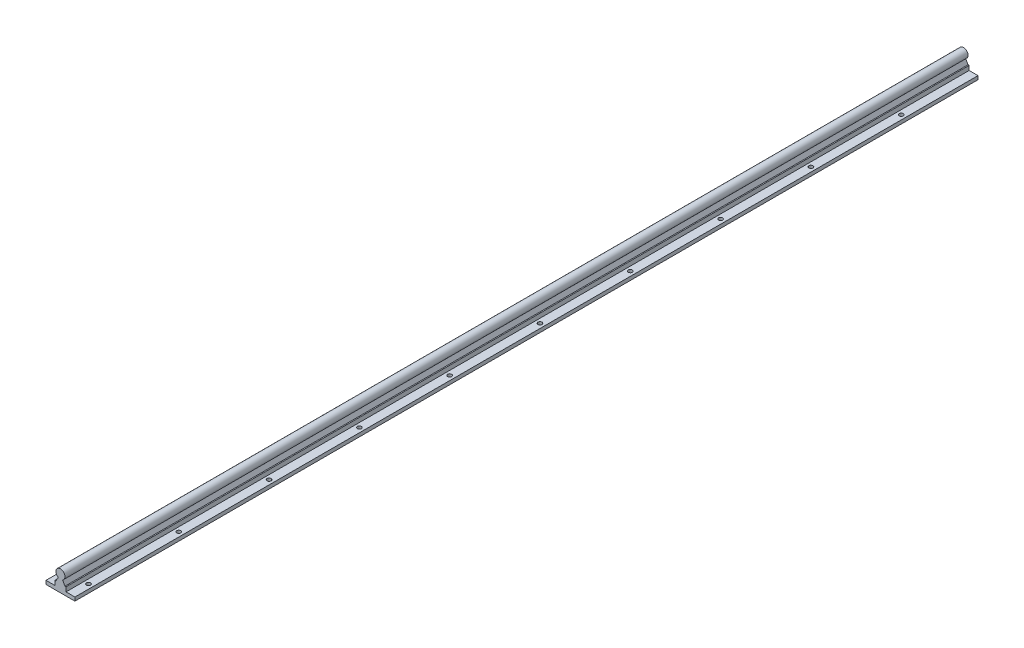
ISO-10303-21;
HEADER;
FILE_DESCRIPTION(('STEP AP214'),'2;1');
FILE_NAME('part.step','',(''),(''),'','','');
FILE_SCHEMA(('AUTOMOTIVE_DESIGN { 1 0 10303 214 1 1 1 1 }'));
ENDSEC;
DATA;
#1=APPLICATION_CONTEXT('core data for automotive mechanical design processes');
#2=APPLICATION_PROTOCOL_DEFINITION('international standard','automotive_design',2000,#1);
#3=PRODUCT_CONTEXT('',#1,'mechanical');
#4=PRODUCT('Part','Part','',(#3));
#5=PRODUCT_RELATED_PRODUCT_CATEGORY('part','',(#4));
#6=PRODUCT_DEFINITION_FORMATION('','',#4);
#7=PRODUCT_DEFINITION_CONTEXT('part definition',#1,'design');
#8=PRODUCT_DEFINITION('design','',#6,#7);
#9=PRODUCT_DEFINITION_SHAPE('','',#8);
#10=(LENGTH_UNIT() NAMED_UNIT(*) SI_UNIT(.MILLI.,.METRE.));
#11=(NAMED_UNIT(*) PLANE_ANGLE_UNIT() SI_UNIT($,.RADIAN.));
#12=(NAMED_UNIT(*) SI_UNIT($,.STERADIAN.) SOLID_ANGLE_UNIT());
#13=UNCERTAINTY_MEASURE_WITH_UNIT(LENGTH_MEASURE(1.E-05),#10,'distance_accuracy_value','');
#14=(GEOMETRIC_REPRESENTATION_CONTEXT(3) GLOBAL_UNCERTAINTY_ASSIGNED_CONTEXT((#13)) GLOBAL_UNIT_ASSIGNED_CONTEXT((#10,
#11,#12)) REPRESENTATION_CONTEXT('',''));
#15=CARTESIAN_POINT('',(0.,0.,0.));
#16=DIRECTION('',(0.,0.,1.));
#17=DIRECTION('',(1.,0.,0.));
#18=AXIS2_PLACEMENT_3D('',#15,#16,#17);
#19=CARTESIAN_POINT('',(-6.2,-7.50000000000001,1000.));
#20=DIRECTION('',(0.,-1.,0.));
#21=DIRECTION('',(0.,0.,-1.));
#22=AXIS2_PLACEMENT_3D('',#19,#20,#21);
#23=PLANE('',#22);
#24=CARTESIAN_POINT('',(-11.,-7.50000000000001,180.000000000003));
#25=DIRECTION('',(0.,1.,0.));
#26=DIRECTION('',(0.,0.,1.));
#27=AXIS2_PLACEMENT_3D('',#24,#25,#26);
#28=CIRCLE('',#27,2.25);
#29=CARTESIAN_POINT('',(-11.,-7.50000000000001,182.250000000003));
#30=VERTEX_POINT('',#29);
#31=EDGE_CURVE('E779',#30,#30,#28,.T.);
#32=ORIENTED_EDGE('',*,*,#31,.F.);
#33=EDGE_LOOP('',(#32));
#34=FACE_BOUND('',#33,.T.);
#35=CARTESIAN_POINT('',(-11.,-7.50000000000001,280.000000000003));
#36=DIRECTION('',(0.,1.,0.));
#37=DIRECTION('',(0.,0.,1.));
#38=AXIS2_PLACEMENT_3D('',#35,#36,#37);
#39=CIRCLE('',#38,2.25);
#40=CARTESIAN_POINT('',(-11.,-7.50000000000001,282.250000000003));
#41=VERTEX_POINT('',#40);
#42=EDGE_CURVE('E789',#41,#41,#39,.T.);
#43=ORIENTED_EDGE('',*,*,#42,.F.);
#44=EDGE_LOOP('',(#43));
#45=FACE_BOUND('',#44,.T.);
#46=CARTESIAN_POINT('',(-11.,-7.50000000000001,380.000000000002));
#47=DIRECTION('',(0.,1.,0.));
#48=DIRECTION('',(0.,0.,1.));
#49=AXIS2_PLACEMENT_3D('',#46,#47,#48);
#50=CIRCLE('',#49,2.25);
#51=CARTESIAN_POINT('',(-11.,-7.50000000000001,382.250000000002));
#52=VERTEX_POINT('',#51);
#53=EDGE_CURVE('E797',#52,#52,#50,.T.);
#54=ORIENTED_EDGE('',*,*,#53,.F.);
#55=EDGE_LOOP('',(#54));
#56=FACE_BOUND('',#55,.T.);
#57=CARTESIAN_POINT('',(-11.,-7.50000000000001,480.000000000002));
#58=DIRECTION('',(0.,1.,0.));
#59=DIRECTION('',(0.,0.,1.));
#60=AXIS2_PLACEMENT_3D('',#57,#58,#59);
#61=CIRCLE('',#60,2.25);
#62=CARTESIAN_POINT('',(-11.,-7.50000000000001,482.250000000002));
#63=VERTEX_POINT('',#62);
#64=EDGE_CURVE('E805',#63,#63,#61,.T.);
#65=ORIENTED_EDGE('',*,*,#64,.F.);
#66=EDGE_LOOP('',(#65));
#67=FACE_BOUND('',#66,.T.);
#68=CARTESIAN_POINT('',(-11.,-7.50000000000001,580.000000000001));
#69=DIRECTION('',(0.,1.,0.));
#70=DIRECTION('',(0.,0.,1.));
#71=AXIS2_PLACEMENT_3D('',#68,#69,#70);
#72=CIRCLE('',#71,2.25);
#73=CARTESIAN_POINT('',(-11.,-7.50000000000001,582.250000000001));
#74=VERTEX_POINT('',#73);
#75=EDGE_CURVE('E813',#74,#74,#72,.T.);
#76=ORIENTED_EDGE('',*,*,#75,.F.);
#77=EDGE_LOOP('',(#76));
#78=FACE_BOUND('',#77,.T.);
#79=CARTESIAN_POINT('',(-11.,-7.50000000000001,680.000000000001));
#80=DIRECTION('',(0.,1.,0.));
#81=DIRECTION('',(0.,0.,1.));
#82=AXIS2_PLACEMENT_3D('',#79,#80,#81);
#83=CIRCLE('',#82,2.25);
#84=CARTESIAN_POINT('',(-11.,-7.50000000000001,682.250000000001));
#85=VERTEX_POINT('',#84);
#86=EDGE_CURVE('E821',#85,#85,#83,.T.);
#87=ORIENTED_EDGE('',*,*,#86,.F.);
#88=EDGE_LOOP('',(#87));
#89=FACE_BOUND('',#88,.T.);
#90=CARTESIAN_POINT('',(-11.,-7.50000000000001,780.000000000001));
#91=DIRECTION('',(0.,1.,0.));
#92=DIRECTION('',(0.,0.,1.));
#93=AXIS2_PLACEMENT_3D('',#90,#91,#92);
#94=CIRCLE('',#93,2.25);
#95=CARTESIAN_POINT('',(-11.,-7.50000000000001,782.250000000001));
#96=VERTEX_POINT('',#95);
#97=EDGE_CURVE('E829',#96,#96,#94,.T.);
#98=ORIENTED_EDGE('',*,*,#97,.F.);
#99=EDGE_LOOP('',(#98));
#100=FACE_BOUND('',#99,.T.);
#101=CARTESIAN_POINT('',(-11.,-7.50000000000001,880.));
#102=DIRECTION('',(0.,1.,0.));
#103=DIRECTION('',(0.,0.,1.));
#104=AXIS2_PLACEMENT_3D('',#101,#102,#103);
#105=CIRCLE('',#104,2.25);
#106=CARTESIAN_POINT('',(-11.,-7.50000000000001,882.25));
#107=VERTEX_POINT('',#106);
#108=EDGE_CURVE('E837',#107,#107,#105,.T.);
#109=ORIENTED_EDGE('',*,*,#108,.F.);
#110=EDGE_LOOP('',(#109));
#111=FACE_BOUND('',#110,.T.);
#112=CARTESIAN_POINT('',(-11.,-7.50000000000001,980.));
#113=DIRECTION('',(0.,1.,0.));
#114=DIRECTION('',(0.,0.,1.));
#115=AXIS2_PLACEMENT_3D('',#112,#113,#114);
#116=CIRCLE('',#115,2.25);
#117=CARTESIAN_POINT('',(-11.,-7.50000000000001,982.25));
#118=VERTEX_POINT('',#117);
#119=EDGE_CURVE('E917',#118,#118,#116,.T.);
#120=ORIENTED_EDGE('',*,*,#119,.F.);
#121=EDGE_LOOP('',(#120));
#122=FACE_BOUND('',#121,.T.);
#123=DIRECTION('',(-1.,0.,0.));
#124=VECTOR('',#123,1.);
#125=CARTESIAN_POINT('',(-6.2,-7.50000000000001,0.));
#126=LINE('',#125,#124);
#127=CARTESIAN_POINT('',(-6.2,-7.50000000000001,0.));
#128=VERTEX_POINT('',#127);
#129=CARTESIAN_POINT('',(-16.,-7.50000000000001,0.));
#130=VERTEX_POINT('',#129);
#131=EDGE_CURVE('E211',#128,#130,#126,.T.);
#132=ORIENTED_EDGE('',*,*,#131,.T.);
#133=DIRECTION('',(0.,0.,-1.));
#134=VECTOR('',#133,1.);
#135=CARTESIAN_POINT('',(-16.,-7.50000000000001,1000.));
#136=LINE('',#135,#134);
#137=CARTESIAN_POINT('',(-16.,-7.50000000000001,1000.));
#138=VERTEX_POINT('',#137);
#139=EDGE_CURVE('E237',#138,#130,#136,.T.);
#140=ORIENTED_EDGE('',*,*,#139,.F.);
#141=DIRECTION('',(-1.,0.,0.));
#142=VECTOR('',#141,1.);
#143=CARTESIAN_POINT('',(-6.2,-7.50000000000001,1000.));
#144=LINE('',#143,#142);
#145=CARTESIAN_POINT('',(-6.2,-7.50000000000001,1000.));
#146=VERTEX_POINT('',#145);
#147=EDGE_CURVE('E286',#146,#138,#144,.T.);
#148=ORIENTED_EDGE('',*,*,#147,.F.);
#149=DIRECTION('',(0.,0.,-1.));
#150=VECTOR('',#149,1.);
#151=CARTESIAN_POINT('',(-6.2,-7.50000000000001,1000.));
#152=LINE('',#151,#150);
#153=EDGE_CURVE('E241',#146,#128,#152,.T.);
#154=ORIENTED_EDGE('',*,*,#153,.T.);
#155=EDGE_LOOP('',(#132,#140,#148,#154));
#156=FACE_BOUND('',#155,.T.);
#157=CARTESIAN_POINT('',(-11.,-7.50000000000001,80.0000000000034));
#158=DIRECTION('',(0.,1.,0.));
#159=DIRECTION('',(0.,0.,1.));
#160=AXIS2_PLACEMENT_3D('',#157,#158,#159);
#161=CIRCLE('',#160,2.25);
#162=CARTESIAN_POINT('',(-11.,-7.50000000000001,82.2500000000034));
#163=VERTEX_POINT('',#162);
#164=EDGE_CURVE('E774',#163,#163,#161,.T.);
#165=ORIENTED_EDGE('',*,*,#164,.F.);
#166=EDGE_LOOP('',(#165));
#167=FACE_BOUND('',#166,.T.);
#168=ADVANCED_FACE('F64',(#34,#45,#56,#67,#78,#89,#100,#111,#122,#156,#167),#23,.F.);
#169=CARTESIAN_POINT('',(16.,-7.50000000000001,1000.));
#170=DIRECTION('',(0.,-1.,0.));
#171=DIRECTION('',(0.,0.,-1.));
#172=AXIS2_PLACEMENT_3D('',#169,#170,#171);
#173=PLANE('',#172);
#174=CARTESIAN_POINT('',(11.,-7.50000000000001,80.0000000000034));
#175=DIRECTION('',(0.,1.,0.));
#176=DIRECTION('',(0.,0.,1.));
#177=AXIS2_PLACEMENT_3D('',#174,#175,#176);
#178=CIRCLE('',#177,2.25);
#179=CARTESIAN_POINT('',(11.,-7.50000000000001,82.2500000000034));
#180=VERTEX_POINT('',#179);
#181=EDGE_CURVE('E845',#180,#180,#178,.T.);
#182=ORIENTED_EDGE('',*,*,#181,.F.);
#183=EDGE_LOOP('',(#182));
#184=FACE_BOUND('',#183,.T.);
#185=CARTESIAN_POINT('',(11.,-7.50000000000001,380.000000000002));
#186=DIRECTION('',(0.,1.,0.));
#187=DIRECTION('',(0.,0.,1.));
#188=AXIS2_PLACEMENT_3D('',#185,#186,#187);
#189=CIRCLE('',#188,2.25);
#190=CARTESIAN_POINT('',(11.,-7.50000000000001,382.250000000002));
#191=VERTEX_POINT('',#190);
#192=EDGE_CURVE('E869',#191,#191,#189,.T.);
#193=ORIENTED_EDGE('',*,*,#192,.F.);
#194=EDGE_LOOP('',(#193));
#195=FACE_BOUND('',#194,.T.);
#196=CARTESIAN_POINT('',(11.,-7.50000000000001,480.000000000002));
#197=DIRECTION('',(0.,1.,0.));
#198=DIRECTION('',(0.,0.,1.));
#199=AXIS2_PLACEMENT_3D('',#196,#197,#198);
#200=CIRCLE('',#199,2.25);
#201=CARTESIAN_POINT('',(11.,-7.50000000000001,482.250000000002));
#202=VERTEX_POINT('',#201);
#203=EDGE_CURVE('E877',#202,#202,#200,.T.);
#204=ORIENTED_EDGE('',*,*,#203,.F.);
#205=EDGE_LOOP('',(#204));
#206=FACE_BOUND('',#205,.T.);
#207=CARTESIAN_POINT('',(11.,-7.50000000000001,580.000000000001));
#208=DIRECTION('',(0.,1.,0.));
#209=DIRECTION('',(0.,0.,1.));
#210=AXIS2_PLACEMENT_3D('',#207,#208,#209);
#211=CIRCLE('',#210,2.25);
#212=CARTESIAN_POINT('',(11.,-7.50000000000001,582.250000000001));
#213=VERTEX_POINT('',#212);
#214=EDGE_CURVE('E885',#213,#213,#211,.T.);
#215=ORIENTED_EDGE('',*,*,#214,.F.);
#216=EDGE_LOOP('',(#215));
#217=FACE_BOUND('',#216,.T.);
#218=CARTESIAN_POINT('',(11.,-7.50000000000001,680.000000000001));
#219=DIRECTION('',(0.,1.,0.));
#220=DIRECTION('',(0.,0.,1.));
#221=AXIS2_PLACEMENT_3D('',#218,#219,#220);
#222=CIRCLE('',#221,2.25);
#223=CARTESIAN_POINT('',(11.,-7.50000000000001,682.250000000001));
#224=VERTEX_POINT('',#223);
#225=EDGE_CURVE('E893',#224,#224,#222,.T.);
#226=ORIENTED_EDGE('',*,*,#225,.F.);
#227=EDGE_LOOP('',(#226));
#228=FACE_BOUND('',#227,.T.);
#229=CARTESIAN_POINT('',(11.,-7.50000000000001,780.000000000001));
#230=DIRECTION('',(0.,1.,0.));
#231=DIRECTION('',(0.,0.,1.));
#232=AXIS2_PLACEMENT_3D('',#229,#230,#231);
#233=CIRCLE('',#232,2.25);
#234=CARTESIAN_POINT('',(11.,-7.50000000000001,782.250000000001));
#235=VERTEX_POINT('',#234);
#236=EDGE_CURVE('E901',#235,#235,#233,.T.);
#237=ORIENTED_EDGE('',*,*,#236,.F.);
#238=EDGE_LOOP('',(#237));
#239=FACE_BOUND('',#238,.T.);
#240=CARTESIAN_POINT('',(11.,-7.50000000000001,980.));
#241=DIRECTION('',(0.,1.,0.));
#242=DIRECTION('',(0.,0.,1.));
#243=AXIS2_PLACEMENT_3D('',#240,#241,#242);
#244=CIRCLE('',#243,2.25);
#245=CARTESIAN_POINT('',(11.,-7.50000000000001,982.25));
#246=VERTEX_POINT('',#245);
#247=EDGE_CURVE('E925',#246,#246,#244,.T.);
#248=ORIENTED_EDGE('',*,*,#247,.F.);
#249=EDGE_LOOP('',(#248));
#250=FACE_BOUND('',#249,.T.);
#251=DIRECTION('',(-1.,0.,0.));
#252=VECTOR('',#251,1.);
#253=CARTESIAN_POINT('',(16.,-7.50000000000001,0.));
#254=LINE('',#253,#252);
#255=CARTESIAN_POINT('',(16.,-7.50000000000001,0.));
#256=VERTEX_POINT('',#255);
#257=CARTESIAN_POINT('',(6.2,-7.50000000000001,0.));
#258=VERTEX_POINT('',#257);
#259=EDGE_CURVE('E123',#256,#258,#254,.T.);
#260=ORIENTED_EDGE('',*,*,#259,.T.);
#261=DIRECTION('',(0.,0.,-1.));
#262=VECTOR('',#261,1.);
#263=CARTESIAN_POINT('',(6.2,-7.50000000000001,1000.));
#264=LINE('',#263,#262);
#265=CARTESIAN_POINT('',(6.2,-7.50000000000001,1000.));
#266=VERTEX_POINT('',#265);
#267=EDGE_CURVE('E180',#266,#258,#264,.T.);
#268=ORIENTED_EDGE('',*,*,#267,.F.);
#269=DIRECTION('',(-1.,0.,0.));
#270=VECTOR('',#269,1.);
#271=CARTESIAN_POINT('',(16.,-7.50000000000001,1000.));
#272=LINE('',#271,#270);
#273=CARTESIAN_POINT('',(16.,-7.50000000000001,1000.));
#274=VERTEX_POINT('',#273);
#275=EDGE_CURVE('E166',#274,#266,#272,.T.);
#276=ORIENTED_EDGE('',*,*,#275,.F.);
#277=DIRECTION('',(0.,0.,-1.));
#278=VECTOR('',#277,1.);
#279=CARTESIAN_POINT('',(16.,-7.50000000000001,1000.));
#280=LINE('',#279,#278);
#281=EDGE_CURVE('E174',#274,#256,#280,.T.);
#282=ORIENTED_EDGE('',*,*,#281,.T.);
#283=EDGE_LOOP('',(#260,#268,#276,#282));
#284=FACE_BOUND('',#283,.T.);
#285=CARTESIAN_POINT('',(11.,-7.50000000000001,880.));
#286=DIRECTION('',(0.,1.,0.));
#287=DIRECTION('',(0.,0.,1.));
#288=AXIS2_PLACEMENT_3D('',#285,#286,#287);
#289=CIRCLE('',#288,2.25);
#290=CARTESIAN_POINT('',(11.,-7.50000000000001,882.25));
#291=VERTEX_POINT('',#290);
#292=EDGE_CURVE('E909',#291,#291,#289,.T.);
#293=ORIENTED_EDGE('',*,*,#292,.F.);
#294=EDGE_LOOP('',(#293));
#295=FACE_BOUND('',#294,.T.);
#296=CARTESIAN_POINT('',(11.,-7.50000000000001,280.000000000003));
#297=DIRECTION('',(0.,1.,0.));
#298=DIRECTION('',(0.,0.,1.));
#299=AXIS2_PLACEMENT_3D('',#296,#297,#298);
#300=CIRCLE('',#299,2.25);
#301=CARTESIAN_POINT('',(11.,-7.50000000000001,282.250000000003));
#302=VERTEX_POINT('',#301);
#303=EDGE_CURVE('E861',#302,#302,#300,.T.);
#304=ORIENTED_EDGE('',*,*,#303,.F.);
#305=EDGE_LOOP('',(#304));
#306=FACE_BOUND('',#305,.T.);
#307=CARTESIAN_POINT('',(11.,-7.50000000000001,180.000000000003));
#308=DIRECTION('',(0.,1.,0.));
#309=DIRECTION('',(0.,0.,1.));
#310=AXIS2_PLACEMENT_3D('',#307,#308,#309);
#311=CIRCLE('',#310,2.25);
#312=CARTESIAN_POINT('',(11.,-7.50000000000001,182.250000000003));
#313=VERTEX_POINT('',#312);
#314=EDGE_CURVE('E853',#313,#313,#311,.T.);
#315=ORIENTED_EDGE('',*,*,#314,.F.);
#316=EDGE_LOOP('',(#315));
#317=FACE_BOUND('',#316,.T.);
#318=ADVANCED_FACE('F182',(#184,#195,#206,#217,#228,#239,#250,#284,#295,#306,#317),#173,.F.);
#319=CARTESIAN_POINT('',(6.2,-2.60000000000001,1000.));
#320=DIRECTION('',(0.,-1.,0.));
#321=DIRECTION('',(0.,0.,-1.));
#322=AXIS2_PLACEMENT_3D('',#319,#320,#321);
#323=PLANE('',#322);
#324=DIRECTION('',(-1.,0.,0.));
#325=VECTOR('',#324,1.);
#326=CARTESIAN_POINT('',(6.2,-2.60000000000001,0.));
#327=LINE('',#326,#325);
#328=CARTESIAN_POINT('',(6.2,-2.60000000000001,0.));
#329=VERTEX_POINT('',#328);
#330=CARTESIAN_POINT('',(5.,-2.60000000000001,0.));
#331=VERTEX_POINT('',#330);
#332=EDGE_CURVE('E191',#329,#331,#327,.T.);
#333=ORIENTED_EDGE('',*,*,#332,.T.);
#334=DIRECTION('',(0.,0.,-1.));
#335=VECTOR('',#334,1.);
#336=CARTESIAN_POINT('',(5.,-2.60000000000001,1000.));
#337=LINE('',#336,#335);
#338=CARTESIAN_POINT('',(5.,-2.60000000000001,1000.));
#339=VERTEX_POINT('',#338);
#340=EDGE_CURVE('E12',#339,#331,#337,.T.);
#341=ORIENTED_EDGE('',*,*,#340,.F.);
#342=DIRECTION('',(-1.,0.,0.));
#343=VECTOR('',#342,1.);
#344=CARTESIAN_POINT('',(6.2,-2.60000000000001,1000.));
#345=LINE('',#344,#343);
#346=CARTESIAN_POINT('',(6.2,-2.60000000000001,1000.));
#347=VERTEX_POINT('',#346);
#348=EDGE_CURVE('E226',#347,#339,#345,.T.);
#349=ORIENTED_EDGE('',*,*,#348,.F.);
#350=DIRECTION('',(0.,0.,-1.));
#351=VECTOR('',#350,1.);
#352=CARTESIAN_POINT('',(6.2,-2.60000000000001,1000.));
#353=LINE('',#352,#351);
#354=EDGE_CURVE('E187',#347,#329,#353,.T.);
#355=ORIENTED_EDGE('',*,*,#354,.T.);
#356=EDGE_LOOP('',(#333,#341,#349,#355));
#357=FACE_BOUND('',#356,.T.);
#358=ADVANCED_FACE('F66',(#357),#323,.F.);
#359=CARTESIAN_POINT('',(5.,-2.60000000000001,1000.));
#360=DIRECTION('',(-0.870482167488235,-0.492199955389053,0.));
#361=DIRECTION('',(0.492199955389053,-0.870482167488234,0.));
#362=AXIS2_PLACEMENT_3D('',#359,#360,#361);
#363=PLANE('',#362);
#364=DIRECTION('',(-0.492199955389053,0.870482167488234,0.));
#365=VECTOR('',#364,1.);
#366=CARTESIAN_POINT('',(5.,-2.60000000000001,0.));
#367=LINE('',#366,#365);
#368=CARTESIAN_POINT('',(2.35,2.08666792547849,0.));
#369=VERTEX_POINT('',#368);
#370=EDGE_CURVE('E195',#331,#369,#367,.T.);
#371=ORIENTED_EDGE('',*,*,#370,.T.);
#372=DIRECTION('',(0.,0.,-1.));
#373=VECTOR('',#372,1.);
#374=CARTESIAN_POINT('',(2.35,2.08666792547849,1000.));
#375=LINE('',#374,#373);
#376=CARTESIAN_POINT('',(2.35,2.08666792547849,1000.));
#377=VERTEX_POINT('',#376);
#378=EDGE_CURVE('E74',#377,#369,#375,.T.);
#379=ORIENTED_EDGE('',*,*,#378,.F.);
#380=DIRECTION('',(-0.492199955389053,0.870482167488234,0.));
#381=VECTOR('',#380,1.);
#382=CARTESIAN_POINT('',(5.,-2.60000000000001,1000.));
#383=LINE('',#382,#381);
#384=EDGE_CURVE('E137',#339,#377,#383,.T.);
#385=ORIENTED_EDGE('',*,*,#384,.F.);
#386=ORIENTED_EDGE('',*,*,#340,.T.);
#387=EDGE_LOOP('',(#371,#379,#385,#386));
#388=FACE_BOUND('',#387,.T.);
#389=ADVANCED_FACE('F341',(#388),#363,.F.);
#390=CARTESIAN_POINT('',(0.,6.49999999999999,1000.));
#391=DIRECTION('',(0.,0.,-1.));
#392=DIRECTION('',(-1.,0.,0.));
#393=AXIS2_PLACEMENT_3D('',#390,#391,#392);
#394=CYLINDRICAL_SURFACE('',#393,5.00000000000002);
#395=CARTESIAN_POINT('',(0.,6.49999999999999,0.));
#396=DIRECTION('',(0.,0.,1.));
#397=DIRECTION('',(1.,0.,0.));
#398=AXIS2_PLACEMENT_3D('',#395,#396,#397);
#399=CIRCLE('',#398,5.00000000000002);
#400=CARTESIAN_POINT('',(-2.35,2.08666792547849,0.));
#401=VERTEX_POINT('',#400);
#402=EDGE_CURVE('E199',#369,#401,#399,.T.);
#403=ORIENTED_EDGE('',*,*,#402,.T.);
#404=DIRECTION('',(0.,0.,-1.));
#405=VECTOR('',#404,1.);
#406=CARTESIAN_POINT('',(-2.35,2.08666792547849,1000.));
#407=LINE('',#406,#405);
#408=CARTESIAN_POINT('',(-2.35,2.08666792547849,1000.));
#409=VERTEX_POINT('',#408);
#410=EDGE_CURVE('E253',#409,#401,#407,.T.);
#411=ORIENTED_EDGE('',*,*,#410,.F.);
#412=CARTESIAN_POINT('',(0.,6.49999999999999,1000.));
#413=DIRECTION('',(0.,0.,1.));
#414=DIRECTION('',(1.,0.,0.));
#415=AXIS2_PLACEMENT_3D('',#412,#413,#414);
#416=CIRCLE('',#415,5.00000000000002);
#417=EDGE_CURVE('E263',#377,#409,#416,.T.);
#418=ORIENTED_EDGE('',*,*,#417,.F.);
#419=ORIENTED_EDGE('',*,*,#378,.T.);
#420=EDGE_LOOP('',(#403,#411,#418,#419));
#421=FACE_BOUND('',#420,.T.);
#422=ADVANCED_FACE('F261',(#421),#394,.T.);
#423=CARTESIAN_POINT('',(-2.35,2.08666792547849,1000.));
#424=DIRECTION('',(0.870482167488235,-0.492199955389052,0.));
#425=DIRECTION('',(0.492199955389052,0.870482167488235,0.));
#426=AXIS2_PLACEMENT_3D('',#423,#424,#425);
#427=PLANE('',#426);
#428=DIRECTION('',(-0.492199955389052,-0.870482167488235,0.));
#429=VECTOR('',#428,1.);
#430=CARTESIAN_POINT('',(-2.35,2.08666792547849,0.));
#431=LINE('',#430,#429);
#432=CARTESIAN_POINT('',(-5.,-2.60000000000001,0.));
#433=VERTEX_POINT('',#432);
#434=EDGE_CURVE('E202',#401,#433,#431,.T.);
#435=ORIENTED_EDGE('',*,*,#434,.T.);
#436=DIRECTION('',(0.,0.,-1.));
#437=VECTOR('',#436,1.);
#438=CARTESIAN_POINT('',(-5.,-2.60000000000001,1000.));
#439=LINE('',#438,#437);
#440=CARTESIAN_POINT('',(-5.,-2.60000000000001,1000.));
#441=VERTEX_POINT('',#440);
#442=EDGE_CURVE('E249',#441,#433,#439,.T.);
#443=ORIENTED_EDGE('',*,*,#442,.F.);
#444=DIRECTION('',(-0.492199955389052,-0.870482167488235,0.));
#445=VECTOR('',#444,1.);
#446=CARTESIAN_POINT('',(-2.35,2.08666792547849,1000.));
#447=LINE('',#446,#445);
#448=EDGE_CURVE('E282',#409,#441,#447,.T.);
#449=ORIENTED_EDGE('',*,*,#448,.F.);
#450=ORIENTED_EDGE('',*,*,#410,.T.);
#451=EDGE_LOOP('',(#435,#443,#449,#450));
#452=FACE_BOUND('',#451,.T.);
#453=ADVANCED_FACE('F272',(#452),#427,.F.);
#454=CARTESIAN_POINT('',(-5.,-2.60000000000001,1000.));
#455=DIRECTION('',(0.,-1.,0.));
#456=DIRECTION('',(0.,0.,-1.));
#457=AXIS2_PLACEMENT_3D('',#454,#455,#456);
#458=PLANE('',#457);
#459=DIRECTION('',(-1.,0.,0.));
#460=VECTOR('',#459,1.);
#461=CARTESIAN_POINT('',(-5.,-2.60000000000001,0.));
#462=LINE('',#461,#460);
#463=CARTESIAN_POINT('',(-6.2,-2.60000000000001,0.));
#464=VERTEX_POINT('',#463);
#465=EDGE_CURVE('E205',#433,#464,#462,.T.);
#466=ORIENTED_EDGE('',*,*,#465,.T.);
#467=DIRECTION('',(0.,0.,-1.));
#468=VECTOR('',#467,1.);
#469=CARTESIAN_POINT('',(-6.2,-2.60000000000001,1000.));
#470=LINE('',#469,#468);
#471=CARTESIAN_POINT('',(-6.2,-2.60000000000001,1000.));
#472=VERTEX_POINT('',#471);
#473=EDGE_CURVE('E245',#472,#464,#470,.T.);
#474=ORIENTED_EDGE('',*,*,#473,.F.);
#475=DIRECTION('',(-1.,0.,0.));
#476=VECTOR('',#475,1.);
#477=CARTESIAN_POINT('',(-5.,-2.60000000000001,1000.));
#478=LINE('',#477,#476);
#479=EDGE_CURVE('E278',#441,#472,#478,.T.);
#480=ORIENTED_EDGE('',*,*,#479,.F.);
#481=ORIENTED_EDGE('',*,*,#442,.T.);
#482=EDGE_LOOP('',(#466,#474,#480,#481));
#483=FACE_BOUND('',#482,.T.);
#484=ADVANCED_FACE('F276',(#483),#458,.F.);
#485=CARTESIAN_POINT('',(-6.2,-2.60000000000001,1000.));
#486=DIRECTION('',(1.,0.,0.));
#487=DIRECTION('',(0.,0.,-1.));
#488=AXIS2_PLACEMENT_3D('',#485,#486,#487);
#489=PLANE('',#488);
#490=DIRECTION('',(0.,-1.,0.));
#491=VECTOR('',#490,1.);
#492=CARTESIAN_POINT('',(-6.2,-2.60000000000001,0.));
#493=LINE('',#492,#491);
#494=EDGE_CURVE('E208',#464,#128,#493,.T.);
#495=ORIENTED_EDGE('',*,*,#494,.T.);
#496=ORIENTED_EDGE('',*,*,#153,.F.);
#497=DIRECTION('',(0.,-1.,0.));
#498=VECTOR('',#497,1.);
#499=CARTESIAN_POINT('',(-6.2,-2.60000000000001,1000.));
#500=LINE('',#499,#498);
#501=EDGE_CURVE('E281',#472,#146,#500,.T.);
#502=ORIENTED_EDGE('',*,*,#501,.F.);
#503=ORIENTED_EDGE('',*,*,#473,.T.);
#504=EDGE_LOOP('',(#495,#496,#502,#503));
#505=FACE_BOUND('',#504,.T.);
#506=ADVANCED_FACE('F332',(#505),#489,.F.);
#507=CARTESIAN_POINT('',(-16.,-7.50000000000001,1000.));
#508=DIRECTION('',(1.,0.,0.));
#509=DIRECTION('',(0.,0.,-1.));
#510=AXIS2_PLACEMENT_3D('',#507,#508,#509);
#511=PLANE('',#510);
#512=DIRECTION('',(0.,-1.,0.));
#513=VECTOR('',#512,1.);
#514=CARTESIAN_POINT('',(-16.,-7.50000000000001,0.));
#515=LINE('',#514,#513);
#516=CARTESIAN_POINT('',(-16.,-11.5,0.));
#517=VERTEX_POINT('',#516);
#518=EDGE_CURVE('E214',#130,#517,#515,.T.);
#519=ORIENTED_EDGE('',*,*,#518,.T.);
#520=DIRECTION('',(0.,0.,-1.));
#521=VECTOR('',#520,1.);
#522=CARTESIAN_POINT('',(-16.,-11.5,1000.));
#523=LINE('',#522,#521);
#524=CARTESIAN_POINT('',(-16.,-11.5,1000.));
#525=VERTEX_POINT('',#524);
#526=EDGE_CURVE('E233',#525,#517,#523,.T.);
#527=ORIENTED_EDGE('',*,*,#526,.F.);
#528=DIRECTION('',(0.,-1.,0.));
#529=VECTOR('',#528,1.);
#530=CARTESIAN_POINT('',(-16.,-7.50000000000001,1000.));
#531=LINE('',#530,#529);
#532=EDGE_CURVE('E293',#138,#525,#531,.T.);
#533=ORIENTED_EDGE('',*,*,#532,.F.);
#534=ORIENTED_EDGE('',*,*,#139,.T.);
#535=EDGE_LOOP('',(#519,#527,#533,#534));
#536=FACE_BOUND('',#535,.T.);
#537=ADVANCED_FACE('F301',(#536),#511,.F.);
#538=CARTESIAN_POINT('',(-16.,-11.5,1000.));
#539=DIRECTION('',(0.,1.,0.));
#540=DIRECTION('',(0.,0.,1.));
#541=AXIS2_PLACEMENT_3D('',#538,#539,#540);
#542=PLANE('',#541);
#543=CARTESIAN_POINT('',(-11.,-11.5,80.0000000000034));
#544=DIRECTION('',(0.,1.,0.));
#545=DIRECTION('',(0.,0.,1.));
#546=AXIS2_PLACEMENT_3D('',#543,#544,#545);
#547=CIRCLE('',#546,2.25);
#548=CARTESIAN_POINT('',(-11.,-11.5,82.2500000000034));
#549=VERTEX_POINT('',#548);
#550=EDGE_CURVE('E771',#549,#549,#547,.T.);
#551=ORIENTED_EDGE('',*,*,#550,.T.);
#552=EDGE_LOOP('',(#551));
#553=FACE_BOUND('',#552,.T.);
#554=CARTESIAN_POINT('',(-11.,-11.5,180.000000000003));
#555=DIRECTION('',(0.,1.,0.));
#556=DIRECTION('',(0.,0.,1.));
#557=AXIS2_PLACEMENT_3D('',#554,#555,#556);
#558=CIRCLE('',#557,2.25);
#559=CARTESIAN_POINT('',(-11.,-11.5,182.250000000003));
#560=VERTEX_POINT('',#559);
#561=EDGE_CURVE('E785',#560,#560,#558,.T.);
#562=ORIENTED_EDGE('',*,*,#561,.T.);
#563=EDGE_LOOP('',(#562));
#564=FACE_BOUND('',#563,.T.);
#565=CARTESIAN_POINT('',(-11.,-11.5,280.000000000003));
#566=DIRECTION('',(0.,1.,0.));
#567=DIRECTION('',(0.,0.,1.));
#568=AXIS2_PLACEMENT_3D('',#565,#566,#567);
#569=CIRCLE('',#568,2.25);
#570=CARTESIAN_POINT('',(-11.,-11.5,282.250000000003));
#571=VERTEX_POINT('',#570);
#572=EDGE_CURVE('E793',#571,#571,#569,.T.);
#573=ORIENTED_EDGE('',*,*,#572,.T.);
#574=EDGE_LOOP('',(#573));
#575=FACE_BOUND('',#574,.T.);
#576=CARTESIAN_POINT('',(-11.,-11.5,380.000000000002));
#577=DIRECTION('',(0.,1.,0.));
#578=DIRECTION('',(0.,0.,1.));
#579=AXIS2_PLACEMENT_3D('',#576,#577,#578);
#580=CIRCLE('',#579,2.25);
#581=CARTESIAN_POINT('',(-11.,-11.5,382.250000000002));
#582=VERTEX_POINT('',#581);
#583=EDGE_CURVE('E801',#582,#582,#580,.T.);
#584=ORIENTED_EDGE('',*,*,#583,.T.);
#585=EDGE_LOOP('',(#584));
#586=FACE_BOUND('',#585,.T.);
#587=CARTESIAN_POINT('',(-11.,-11.5,480.000000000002));
#588=DIRECTION('',(0.,1.,0.));
#589=DIRECTION('',(0.,0.,1.));
#590=AXIS2_PLACEMENT_3D('',#587,#588,#589);
#591=CIRCLE('',#590,2.25);
#592=CARTESIAN_POINT('',(-11.,-11.5,482.250000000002));
#593=VERTEX_POINT('',#592);
#594=EDGE_CURVE('E809',#593,#593,#591,.T.);
#595=ORIENTED_EDGE('',*,*,#594,.T.);
#596=EDGE_LOOP('',(#595));
#597=FACE_BOUND('',#596,.T.);
#598=CARTESIAN_POINT('',(-11.,-11.5,580.000000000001));
#599=DIRECTION('',(0.,1.,0.));
#600=DIRECTION('',(0.,0.,1.));
#601=AXIS2_PLACEMENT_3D('',#598,#599,#600);
#602=CIRCLE('',#601,2.25);
#603=CARTESIAN_POINT('',(-11.,-11.5,582.250000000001));
#604=VERTEX_POINT('',#603);
#605=EDGE_CURVE('E817',#604,#604,#602,.T.);
#606=ORIENTED_EDGE('',*,*,#605,.T.);
#607=EDGE_LOOP('',(#606));
#608=FACE_BOUND('',#607,.T.);
#609=CARTESIAN_POINT('',(-11.,-11.5,680.000000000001));
#610=DIRECTION('',(0.,1.,0.));
#611=DIRECTION('',(0.,0.,1.));
#612=AXIS2_PLACEMENT_3D('',#609,#610,#611);
#613=CIRCLE('',#612,2.25);
#614=CARTESIAN_POINT('',(-11.,-11.5,682.250000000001));
#615=VERTEX_POINT('',#614);
#616=EDGE_CURVE('E825',#615,#615,#613,.T.);
#617=ORIENTED_EDGE('',*,*,#616,.T.);
#618=EDGE_LOOP('',(#617));
#619=FACE_BOUND('',#618,.T.);
#620=CARTESIAN_POINT('',(-11.,-11.5,780.000000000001));
#621=DIRECTION('',(0.,1.,0.));
#622=DIRECTION('',(0.,0.,1.));
#623=AXIS2_PLACEMENT_3D('',#620,#621,#622);
#624=CIRCLE('',#623,2.25);
#625=CARTESIAN_POINT('',(-11.,-11.5,782.250000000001));
#626=VERTEX_POINT('',#625);
#627=EDGE_CURVE('E833',#626,#626,#624,.T.);
#628=ORIENTED_EDGE('',*,*,#627,.T.);
#629=EDGE_LOOP('',(#628));
#630=FACE_BOUND('',#629,.T.);
#631=CARTESIAN_POINT('',(-11.,-11.5,880.));
#632=DIRECTION('',(0.,1.,0.));
#633=DIRECTION('',(0.,0.,1.));
#634=AXIS2_PLACEMENT_3D('',#631,#632,#633);
#635=CIRCLE('',#634,2.25);
#636=CARTESIAN_POINT('',(-11.,-11.5,882.25));
#637=VERTEX_POINT('',#636);
#638=EDGE_CURVE('E841',#637,#637,#635,.T.);
#639=ORIENTED_EDGE('',*,*,#638,.T.);
#640=EDGE_LOOP('',(#639));
#641=FACE_BOUND('',#640,.T.);
#642=CARTESIAN_POINT('',(11.,-11.5,80.0000000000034));
#643=DIRECTION('',(0.,1.,0.));
#644=DIRECTION('',(0.,0.,1.));
#645=AXIS2_PLACEMENT_3D('',#642,#643,#644);
#646=CIRCLE('',#645,2.25);
#647=CARTESIAN_POINT('',(11.,-11.5,82.2500000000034));
#648=VERTEX_POINT('',#647);
#649=EDGE_CURVE('E849',#648,#648,#646,.T.);
#650=ORIENTED_EDGE('',*,*,#649,.T.);
#651=EDGE_LOOP('',(#650));
#652=FACE_BOUND('',#651,.T.);
#653=CARTESIAN_POINT('',(11.,-11.5,180.000000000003));
#654=DIRECTION('',(0.,1.,0.));
#655=DIRECTION('',(0.,0.,1.));
#656=AXIS2_PLACEMENT_3D('',#653,#654,#655);
#657=CIRCLE('',#656,2.25);
#658=CARTESIAN_POINT('',(11.,-11.5,182.250000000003));
#659=VERTEX_POINT('',#658);
#660=EDGE_CURVE('E857',#659,#659,#657,.T.);
#661=ORIENTED_EDGE('',*,*,#660,.T.);
#662=EDGE_LOOP('',(#661));
#663=FACE_BOUND('',#662,.T.);
#664=CARTESIAN_POINT('',(11.,-11.5,280.000000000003));
#665=DIRECTION('',(0.,1.,0.));
#666=DIRECTION('',(0.,0.,1.));
#667=AXIS2_PLACEMENT_3D('',#664,#665,#666);
#668=CIRCLE('',#667,2.25);
#669=CARTESIAN_POINT('',(11.,-11.5,282.250000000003));
#670=VERTEX_POINT('',#669);
#671=EDGE_CURVE('E865',#670,#670,#668,.T.);
#672=ORIENTED_EDGE('',*,*,#671,.T.);
#673=EDGE_LOOP('',(#672));
#674=FACE_BOUND('',#673,.T.);
#675=CARTESIAN_POINT('',(11.,-11.5,380.000000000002));
#676=DIRECTION('',(0.,1.,0.));
#677=DIRECTION('',(0.,0.,1.));
#678=AXIS2_PLACEMENT_3D('',#675,#676,#677);
#679=CIRCLE('',#678,2.25);
#680=CARTESIAN_POINT('',(11.,-11.5,382.250000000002));
#681=VERTEX_POINT('',#680);
#682=EDGE_CURVE('E873',#681,#681,#679,.T.);
#683=ORIENTED_EDGE('',*,*,#682,.T.);
#684=EDGE_LOOP('',(#683));
#685=FACE_BOUND('',#684,.T.);
#686=CARTESIAN_POINT('',(11.,-11.5,480.000000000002));
#687=DIRECTION('',(0.,1.,0.));
#688=DIRECTION('',(0.,0.,1.));
#689=AXIS2_PLACEMENT_3D('',#686,#687,#688);
#690=CIRCLE('',#689,2.25);
#691=CARTESIAN_POINT('',(11.,-11.5,482.250000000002));
#692=VERTEX_POINT('',#691);
#693=EDGE_CURVE('E881',#692,#692,#690,.T.);
#694=ORIENTED_EDGE('',*,*,#693,.T.);
#695=EDGE_LOOP('',(#694));
#696=FACE_BOUND('',#695,.T.);
#697=CARTESIAN_POINT('',(11.,-11.5,580.000000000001));
#698=DIRECTION('',(0.,1.,0.));
#699=DIRECTION('',(0.,0.,1.));
#700=AXIS2_PLACEMENT_3D('',#697,#698,#699);
#701=CIRCLE('',#700,2.25);
#702=CARTESIAN_POINT('',(11.,-11.5,582.250000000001));
#703=VERTEX_POINT('',#702);
#704=EDGE_CURVE('E889',#703,#703,#701,.T.);
#705=ORIENTED_EDGE('',*,*,#704,.T.);
#706=EDGE_LOOP('',(#705));
#707=FACE_BOUND('',#706,.T.);
#708=CARTESIAN_POINT('',(11.,-11.5,680.000000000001));
#709=DIRECTION('',(0.,1.,0.));
#710=DIRECTION('',(0.,0.,1.));
#711=AXIS2_PLACEMENT_3D('',#708,#709,#710);
#712=CIRCLE('',#711,2.25);
#713=CARTESIAN_POINT('',(11.,-11.5,682.250000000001));
#714=VERTEX_POINT('',#713);
#715=EDGE_CURVE('E897',#714,#714,#712,.T.);
#716=ORIENTED_EDGE('',*,*,#715,.T.);
#717=EDGE_LOOP('',(#716));
#718=FACE_BOUND('',#717,.T.);
#719=CARTESIAN_POINT('',(11.,-11.5,780.000000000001));
#720=DIRECTION('',(0.,1.,0.));
#721=DIRECTION('',(0.,0.,1.));
#722=AXIS2_PLACEMENT_3D('',#719,#720,#721);
#723=CIRCLE('',#722,2.25);
#724=CARTESIAN_POINT('',(11.,-11.5,782.250000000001));
#725=VERTEX_POINT('',#724);
#726=EDGE_CURVE('E905',#725,#725,#723,.T.);
#727=ORIENTED_EDGE('',*,*,#726,.T.);
#728=EDGE_LOOP('',(#727));
#729=FACE_BOUND('',#728,.T.);
#730=CARTESIAN_POINT('',(11.,-11.5,880.));
#731=DIRECTION('',(0.,1.,0.));
#732=DIRECTION('',(0.,0.,1.));
#733=AXIS2_PLACEMENT_3D('',#730,#731,#732);
#734=CIRCLE('',#733,2.25);
#735=CARTESIAN_POINT('',(11.,-11.5,882.25));
#736=VERTEX_POINT('',#735);
#737=EDGE_CURVE('E913',#736,#736,#734,.T.);
#738=ORIENTED_EDGE('',*,*,#737,.T.);
#739=EDGE_LOOP('',(#738));
#740=FACE_BOUND('',#739,.T.);
#741=CARTESIAN_POINT('',(-11.,-11.5,980.));
#742=DIRECTION('',(0.,1.,0.));
#743=DIRECTION('',(0.,0.,1.));
#744=AXIS2_PLACEMENT_3D('',#741,#742,#743);
#745=CIRCLE('',#744,2.25);
#746=CARTESIAN_POINT('',(-11.,-11.5,982.25));
#747=VERTEX_POINT('',#746);
#748=EDGE_CURVE('E921',#747,#747,#745,.T.);
#749=ORIENTED_EDGE('',*,*,#748,.T.);
#750=EDGE_LOOP('',(#749));
#751=FACE_BOUND('',#750,.T.);
#752=CARTESIAN_POINT('',(11.,-11.5,980.));
#753=DIRECTION('',(0.,1.,0.));
#754=DIRECTION('',(0.,0.,1.));
#755=AXIS2_PLACEMENT_3D('',#752,#753,#754);
#756=CIRCLE('',#755,2.25);
#757=CARTESIAN_POINT('',(11.,-11.5,982.25));
#758=VERTEX_POINT('',#757);
#759=EDGE_CURVE('E196',#758,#758,#756,.T.);
#760=ORIENTED_EDGE('',*,*,#759,.T.);
#761=EDGE_LOOP('',(#760));
#762=FACE_BOUND('',#761,.T.);
#763=DIRECTION('',(1.,0.,0.));
#764=VECTOR('',#763,1.);
#765=CARTESIAN_POINT('',(-16.,-11.5,0.));
#766=LINE('',#765,#764);
#767=CARTESIAN_POINT('',(16.,-11.5,0.));
#768=VERTEX_POINT('',#767);
#769=EDGE_CURVE('E217',#517,#768,#766,.T.);
#770=ORIENTED_EDGE('',*,*,#769,.T.);
#771=DIRECTION('',(0.,0.,-1.));
#772=VECTOR('',#771,1.);
#773=CARTESIAN_POINT('',(16.,-11.5,1000.));
#774=LINE('',#773,#772);
#775=CARTESIAN_POINT('',(16.,-11.5,1000.));
#776=VERTEX_POINT('',#775);
#777=EDGE_CURVE('E179',#776,#768,#774,.T.);
#778=ORIENTED_EDGE('',*,*,#777,.F.);
#779=DIRECTION('',(1.,0.,0.));
#780=VECTOR('',#779,1.);
#781=CARTESIAN_POINT('',(-16.,-11.5,1000.));
#782=LINE('',#781,#780);
#783=EDGE_CURVE('E168',#525,#776,#782,.T.);
#784=ORIENTED_EDGE('',*,*,#783,.F.);
#785=ORIENTED_EDGE('',*,*,#526,.T.);
#786=EDGE_LOOP('',(#770,#778,#784,#785));
#787=FACE_BOUND('',#786,.T.);
#788=ADVANCED_FACE('F305',(#553,#564,#575,#586,#597,#608,#619,#630,#641,#652,#663,#674,#685,
#696,#707,#718,#729,#740,#751,#762,#787),#542,.F.);
#789=CARTESIAN_POINT('',(16.,-11.5,1000.));
#790=DIRECTION('',(-1.,0.,0.));
#791=DIRECTION('',(0.,0.,1.));
#792=AXIS2_PLACEMENT_3D('',#789,#790,#791);
#793=PLANE('',#792);
#794=DIRECTION('',(0.,1.,0.));
#795=VECTOR('',#794,1.);
#796=CARTESIAN_POINT('',(16.,-11.5,0.));
#797=LINE('',#796,#795);
#798=EDGE_CURVE('E177',#768,#256,#797,.T.);
#799=ORIENTED_EDGE('',*,*,#798,.T.);
#800=ORIENTED_EDGE('',*,*,#281,.F.);
#801=DIRECTION('',(0.,1.,0.));
#802=VECTOR('',#801,1.);
#803=CARTESIAN_POINT('',(16.,-11.5,1000.));
#804=LINE('',#803,#802);
#805=EDGE_CURVE('E162',#776,#274,#804,.T.);
#806=ORIENTED_EDGE('',*,*,#805,.F.);
#807=ORIENTED_EDGE('',*,*,#777,.T.);
#808=EDGE_LOOP('',(#799,#800,#806,#807));
#809=FACE_BOUND('',#808,.T.);
#810=ADVANCED_FACE('F175',(#809),#793,.F.);
#811=CARTESIAN_POINT('',(6.2,-7.50000000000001,1000.));
#812=DIRECTION('',(-1.,0.,0.));
#813=DIRECTION('',(0.,0.,1.));
#814=AXIS2_PLACEMENT_3D('',#811,#812,#813);
#815=PLANE('',#814);
#816=DIRECTION('',(0.,1.,0.));
#817=VECTOR('',#816,1.);
#818=CARTESIAN_POINT('',(6.2,-7.50000000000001,0.));
#819=LINE('',#818,#817);
#820=EDGE_CURVE('E129',#258,#329,#819,.T.);
#821=ORIENTED_EDGE('',*,*,#820,.T.);
#822=ORIENTED_EDGE('',*,*,#354,.F.);
#823=DIRECTION('',(0.,1.,0.));
#824=VECTOR('',#823,1.);
#825=CARTESIAN_POINT('',(6.2,-7.50000000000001,1000.));
#826=LINE('',#825,#824);
#827=EDGE_CURVE('E82',#266,#347,#826,.T.);
#828=ORIENTED_EDGE('',*,*,#827,.F.);
#829=ORIENTED_EDGE('',*,*,#267,.T.);
#830=EDGE_LOOP('',(#821,#822,#828,#829));
#831=FACE_BOUND('',#830,.T.);
#832=ADVANCED_FACE('F309',(#831),#815,.F.);
#833=CARTESIAN_POINT('',(0.,6.49999999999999,1000.));
#834=DIRECTION('',(0.,0.,1.));
#835=DIRECTION('',(1.,0.,0.));
#836=AXIS2_PLACEMENT_3D('',#833,#834,#835);
#837=PLANE('',#836);
#838=ORIENTED_EDGE('',*,*,#348,.T.);
#839=ORIENTED_EDGE('',*,*,#384,.T.);
#840=ORIENTED_EDGE('',*,*,#417,.T.);
#841=ORIENTED_EDGE('',*,*,#448,.T.);
#842=ORIENTED_EDGE('',*,*,#479,.T.);
#843=ORIENTED_EDGE('',*,*,#501,.T.);
#844=ORIENTED_EDGE('',*,*,#147,.T.);
#845=ORIENTED_EDGE('',*,*,#532,.T.);
#846=ORIENTED_EDGE('',*,*,#783,.T.);
#847=ORIENTED_EDGE('',*,*,#805,.T.);
#848=ORIENTED_EDGE('',*,*,#275,.T.);
#849=ORIENTED_EDGE('',*,*,#827,.T.);
#850=EDGE_LOOP('',(#838,#839,#840,#841,#842,#843,#844,#845,#846,#847,#848,#849));
#851=FACE_BOUND('',#850,.T.);
#852=ADVANCED_FACE('F164',(#851),#837,.T.);
#853=CARTESIAN_POINT('',(0.,6.49999999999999,0.));
#854=DIRECTION('',(0.,0.,1.));
#855=DIRECTION('',(1.,0.,0.));
#856=AXIS2_PLACEMENT_3D('',#853,#854,#855);
#857=PLANE('',#856);
#858=ORIENTED_EDGE('',*,*,#332,.F.);
#859=ORIENTED_EDGE('',*,*,#820,.F.);
#860=ORIENTED_EDGE('',*,*,#259,.F.);
#861=ORIENTED_EDGE('',*,*,#798,.F.);
#862=ORIENTED_EDGE('',*,*,#769,.F.);
#863=ORIENTED_EDGE('',*,*,#518,.F.);
#864=ORIENTED_EDGE('',*,*,#131,.F.);
#865=ORIENTED_EDGE('',*,*,#494,.F.);
#866=ORIENTED_EDGE('',*,*,#465,.F.);
#867=ORIENTED_EDGE('',*,*,#434,.F.);
#868=ORIENTED_EDGE('',*,*,#402,.F.);
#869=ORIENTED_EDGE('',*,*,#370,.F.);
#870=EDGE_LOOP('',(#858,#859,#860,#861,#862,#863,#864,#865,#866,#867,#868,#869));
#871=FACE_BOUND('',#870,.T.);
#872=ADVANCED_FACE('F267',(#871),#857,.F.);
#873=CARTESIAN_POINT('',(11.,-7.50000000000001,980.));
#874=DIRECTION('',(0.,1.,0.));
#875=DIRECTION('',(0.,0.,1.));
#876=AXIS2_PLACEMENT_3D('',#873,#874,#875);
#877=CYLINDRICAL_SURFACE('',#876,2.25);
#878=ORIENTED_EDGE('',*,*,#759,.F.);
#879=EDGE_LOOP('',(#878));
#880=FACE_BOUND('',#879,.T.);
#881=ORIENTED_EDGE('',*,*,#247,.T.);
#882=EDGE_LOOP('',(#881));
#883=FACE_BOUND('',#882,.T.);
#884=ADVANCED_FACE('F373',(#880,#883),#877,.F.);
#885=CARTESIAN_POINT('',(-11.,-7.50000000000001,980.));
#886=DIRECTION('',(0.,1.,0.));
#887=DIRECTION('',(0.,0.,1.));
#888=AXIS2_PLACEMENT_3D('',#885,#886,#887);
#889=CYLINDRICAL_SURFACE('',#888,2.25);
#890=ORIENTED_EDGE('',*,*,#748,.F.);
#891=EDGE_LOOP('',(#890));
#892=FACE_BOUND('',#891,.T.);
#893=ORIENTED_EDGE('',*,*,#119,.T.);
#894=EDGE_LOOP('',(#893));
#895=FACE_BOUND('',#894,.T.);
#896=ADVANCED_FACE('F366',(#892,#895),#889,.F.);
#897=CARTESIAN_POINT('',(11.,-7.50000000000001,880.));
#898=DIRECTION('',(0.,1.,0.));
#899=DIRECTION('',(0.,0.,1.));
#900=AXIS2_PLACEMENT_3D('',#897,#898,#899);
#901=CYLINDRICAL_SURFACE('',#900,2.25);
#902=ORIENTED_EDGE('',*,*,#737,.F.);
#903=EDGE_LOOP('',(#902));
#904=FACE_BOUND('',#903,.T.);
#905=ORIENTED_EDGE('',*,*,#292,.T.);
#906=EDGE_LOOP('',(#905));
#907=FACE_BOUND('',#906,.T.);
#908=ADVANCED_FACE('F372',(#904,#907),#901,.F.);
#909=CARTESIAN_POINT('',(11.,-7.50000000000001,780.000000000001));
#910=DIRECTION('',(0.,1.,0.));
#911=DIRECTION('',(0.,0.,1.));
#912=AXIS2_PLACEMENT_3D('',#909,#910,#911);
#913=CYLINDRICAL_SURFACE('',#912,2.25);
#914=ORIENTED_EDGE('',*,*,#726,.F.);
#915=EDGE_LOOP('',(#914));
#916=FACE_BOUND('',#915,.T.);
#917=ORIENTED_EDGE('',*,*,#236,.T.);
#918=EDGE_LOOP('',(#917));
#919=FACE_BOUND('',#918,.T.);
#920=ADVANCED_FACE('F508',(#916,#919),#913,.F.);
#921=CARTESIAN_POINT('',(11.,-7.50000000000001,680.000000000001));
#922=DIRECTION('',(0.,1.,0.));
#923=DIRECTION('',(0.,0.,1.));
#924=AXIS2_PLACEMENT_3D('',#921,#922,#923);
#925=CYLINDRICAL_SURFACE('',#924,2.25);
#926=ORIENTED_EDGE('',*,*,#715,.F.);
#927=EDGE_LOOP('',(#926));
#928=FACE_BOUND('',#927,.T.);
#929=ORIENTED_EDGE('',*,*,#225,.T.);
#930=EDGE_LOOP('',(#929));
#931=FACE_BOUND('',#930,.T.);
#932=ADVANCED_FACE('F518',(#928,#931),#925,.F.);
#933=CARTESIAN_POINT('',(11.,-7.50000000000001,580.000000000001));
#934=DIRECTION('',(0.,1.,0.));
#935=DIRECTION('',(0.,0.,1.));
#936=AXIS2_PLACEMENT_3D('',#933,#934,#935);
#937=CYLINDRICAL_SURFACE('',#936,2.25);
#938=ORIENTED_EDGE('',*,*,#704,.F.);
#939=EDGE_LOOP('',(#938));
#940=FACE_BOUND('',#939,.T.);
#941=ORIENTED_EDGE('',*,*,#214,.T.);
#942=EDGE_LOOP('',(#941));
#943=FACE_BOUND('',#942,.T.);
#944=ADVANCED_FACE('F528',(#940,#943),#937,.F.);
#945=CARTESIAN_POINT('',(11.,-7.50000000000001,480.000000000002));
#946=DIRECTION('',(0.,1.,0.));
#947=DIRECTION('',(0.,0.,1.));
#948=AXIS2_PLACEMENT_3D('',#945,#946,#947);
#949=CYLINDRICAL_SURFACE('',#948,2.25);
#950=ORIENTED_EDGE('',*,*,#693,.F.);
#951=EDGE_LOOP('',(#950));
#952=FACE_BOUND('',#951,.T.);
#953=ORIENTED_EDGE('',*,*,#203,.T.);
#954=EDGE_LOOP('',(#953));
#955=FACE_BOUND('',#954,.T.);
#956=ADVANCED_FACE('F538',(#952,#955),#949,.F.);
#957=CARTESIAN_POINT('',(11.,-7.50000000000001,380.000000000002));
#958=DIRECTION('',(0.,1.,0.));
#959=DIRECTION('',(0.,0.,1.));
#960=AXIS2_PLACEMENT_3D('',#957,#958,#959);
#961=CYLINDRICAL_SURFACE('',#960,2.25);
#962=ORIENTED_EDGE('',*,*,#682,.F.);
#963=EDGE_LOOP('',(#962));
#964=FACE_BOUND('',#963,.T.);
#965=ORIENTED_EDGE('',*,*,#192,.T.);
#966=EDGE_LOOP('',(#965));
#967=FACE_BOUND('',#966,.T.);
#968=ADVANCED_FACE('F548',(#964,#967),#961,.F.);
#969=CARTESIAN_POINT('',(11.,-7.50000000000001,280.000000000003));
#970=DIRECTION('',(0.,1.,0.));
#971=DIRECTION('',(0.,0.,1.));
#972=AXIS2_PLACEMENT_3D('',#969,#970,#971);
#973=CYLINDRICAL_SURFACE('',#972,2.25);
#974=ORIENTED_EDGE('',*,*,#671,.F.);
#975=EDGE_LOOP('',(#974));
#976=FACE_BOUND('',#975,.T.);
#977=ORIENTED_EDGE('',*,*,#303,.T.);
#978=EDGE_LOOP('',(#977));
#979=FACE_BOUND('',#978,.T.);
#980=ADVANCED_FACE('F558',(#976,#979),#973,.F.);
#981=CARTESIAN_POINT('',(11.,-7.50000000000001,180.000000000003));
#982=DIRECTION('',(0.,1.,0.));
#983=DIRECTION('',(0.,0.,1.));
#984=AXIS2_PLACEMENT_3D('',#981,#982,#983);
#985=CYLINDRICAL_SURFACE('',#984,2.25);
#986=ORIENTED_EDGE('',*,*,#660,.F.);
#987=EDGE_LOOP('',(#986));
#988=FACE_BOUND('',#987,.T.);
#989=ORIENTED_EDGE('',*,*,#314,.T.);
#990=EDGE_LOOP('',(#989));
#991=FACE_BOUND('',#990,.T.);
#992=ADVANCED_FACE('F568',(#988,#991),#985,.F.);
#993=CARTESIAN_POINT('',(11.,-7.50000000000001,80.0000000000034));
#994=DIRECTION('',(0.,1.,0.));
#995=DIRECTION('',(0.,0.,1.));
#996=AXIS2_PLACEMENT_3D('',#993,#994,#995);
#997=CYLINDRICAL_SURFACE('',#996,2.25);
#998=ORIENTED_EDGE('',*,*,#649,.F.);
#999=EDGE_LOOP('',(#998));
#1000=FACE_BOUND('',#999,.T.);
#1001=ORIENTED_EDGE('',*,*,#181,.T.);
#1002=EDGE_LOOP('',(#1001));
#1003=FACE_BOUND('',#1002,.T.);
#1004=ADVANCED_FACE('F577',(#1000,#1003),#997,.F.);
#1005=CARTESIAN_POINT('',(-11.,-7.50000000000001,880.));
#1006=DIRECTION('',(0.,1.,0.));
#1007=DIRECTION('',(0.,0.,1.));
#1008=AXIS2_PLACEMENT_3D('',#1005,#1006,#1007);
#1009=CYLINDRICAL_SURFACE('',#1008,2.25);
#1010=ORIENTED_EDGE('',*,*,#638,.F.);
#1011=EDGE_LOOP('',(#1010));
#1012=FACE_BOUND('',#1011,.T.);
#1013=ORIENTED_EDGE('',*,*,#108,.T.);
#1014=EDGE_LOOP('',(#1013));
#1015=FACE_BOUND('',#1014,.T.);
#1016=ADVANCED_FACE('F586',(#1012,#1015),#1009,.F.);
#1017=CARTESIAN_POINT('',(-11.,-7.50000000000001,780.000000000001));
#1018=DIRECTION('',(0.,1.,0.));
#1019=DIRECTION('',(0.,0.,1.));
#1020=AXIS2_PLACEMENT_3D('',#1017,#1018,#1019);
#1021=CYLINDRICAL_SURFACE('',#1020,2.25);
#1022=ORIENTED_EDGE('',*,*,#627,.F.);
#1023=EDGE_LOOP('',(#1022));
#1024=FACE_BOUND('',#1023,.T.);
#1025=ORIENTED_EDGE('',*,*,#97,.T.);
#1026=EDGE_LOOP('',(#1025));
#1027=FACE_BOUND('',#1026,.T.);
#1028=ADVANCED_FACE('F602',(#1024,#1027),#1021,.F.);
#1029=CARTESIAN_POINT('',(-11.,-7.50000000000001,680.000000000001));
#1030=DIRECTION('',(0.,1.,0.));
#1031=DIRECTION('',(0.,0.,1.));
#1032=AXIS2_PLACEMENT_3D('',#1029,#1030,#1031);
#1033=CYLINDRICAL_SURFACE('',#1032,2.25);
#1034=ORIENTED_EDGE('',*,*,#616,.F.);
#1035=EDGE_LOOP('',(#1034));
#1036=FACE_BOUND('',#1035,.T.);
#1037=ORIENTED_EDGE('',*,*,#86,.T.);
#1038=EDGE_LOOP('',(#1037));
#1039=FACE_BOUND('',#1038,.T.);
#1040=ADVANCED_FACE('F614',(#1036,#1039),#1033,.F.);
#1041=CARTESIAN_POINT('',(-11.,-7.50000000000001,580.000000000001));
#1042=DIRECTION('',(0.,1.,0.));
#1043=DIRECTION('',(0.,0.,1.));
#1044=AXIS2_PLACEMENT_3D('',#1041,#1042,#1043);
#1045=CYLINDRICAL_SURFACE('',#1044,2.25);
#1046=ORIENTED_EDGE('',*,*,#605,.F.);
#1047=EDGE_LOOP('',(#1046));
#1048=FACE_BOUND('',#1047,.T.);
#1049=ORIENTED_EDGE('',*,*,#75,.T.);
#1050=EDGE_LOOP('',(#1049));
#1051=FACE_BOUND('',#1050,.T.);
#1052=ADVANCED_FACE('F626',(#1048,#1051),#1045,.F.);
#1053=CARTESIAN_POINT('',(-11.,-7.50000000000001,480.000000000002));
#1054=DIRECTION('',(0.,1.,0.));
#1055=DIRECTION('',(0.,0.,1.));
#1056=AXIS2_PLACEMENT_3D('',#1053,#1054,#1055);
#1057=CYLINDRICAL_SURFACE('',#1056,2.25);
#1058=ORIENTED_EDGE('',*,*,#594,.F.);
#1059=EDGE_LOOP('',(#1058));
#1060=FACE_BOUND('',#1059,.T.);
#1061=ORIENTED_EDGE('',*,*,#64,.T.);
#1062=EDGE_LOOP('',(#1061));
#1063=FACE_BOUND('',#1062,.T.);
#1064=ADVANCED_FACE('F638',(#1060,#1063),#1057,.F.);
#1065=CARTESIAN_POINT('',(-11.,-7.50000000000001,380.000000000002));
#1066=DIRECTION('',(0.,1.,0.));
#1067=DIRECTION('',(0.,0.,1.));
#1068=AXIS2_PLACEMENT_3D('',#1065,#1066,#1067);
#1069=CYLINDRICAL_SURFACE('',#1068,2.25);
#1070=ORIENTED_EDGE('',*,*,#583,.F.);
#1071=EDGE_LOOP('',(#1070));
#1072=FACE_BOUND('',#1071,.T.);
#1073=ORIENTED_EDGE('',*,*,#53,.T.);
#1074=EDGE_LOOP('',(#1073));
#1075=FACE_BOUND('',#1074,.T.);
#1076=ADVANCED_FACE('F650',(#1072,#1075),#1069,.F.);
#1077=CARTESIAN_POINT('',(-11.,-7.50000000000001,280.000000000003));
#1078=DIRECTION('',(0.,1.,0.));
#1079=DIRECTION('',(0.,0.,1.));
#1080=AXIS2_PLACEMENT_3D('',#1077,#1078,#1079);
#1081=CYLINDRICAL_SURFACE('',#1080,2.25);
#1082=ORIENTED_EDGE('',*,*,#572,.F.);
#1083=EDGE_LOOP('',(#1082));
#1084=FACE_BOUND('',#1083,.T.);
#1085=ORIENTED_EDGE('',*,*,#42,.T.);
#1086=EDGE_LOOP('',(#1085));
#1087=FACE_BOUND('',#1086,.T.);
#1088=ADVANCED_FACE('F662',(#1084,#1087),#1081,.F.);
#1089=CARTESIAN_POINT('',(-11.,-7.50000000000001,180.000000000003));
#1090=DIRECTION('',(0.,1.,0.));
#1091=DIRECTION('',(0.,0.,1.));
#1092=AXIS2_PLACEMENT_3D('',#1089,#1090,#1091);
#1093=CYLINDRICAL_SURFACE('',#1092,2.25);
#1094=ORIENTED_EDGE('',*,*,#561,.F.);
#1095=EDGE_LOOP('',(#1094));
#1096=FACE_BOUND('',#1095,.T.);
#1097=ORIENTED_EDGE('',*,*,#31,.T.);
#1098=EDGE_LOOP('',(#1097));
#1099=FACE_BOUND('',#1098,.T.);
#1100=ADVANCED_FACE('F674',(#1096,#1099),#1093,.F.);
#1101=CARTESIAN_POINT('',(-11.,-7.50000000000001,80.0000000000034));
#1102=DIRECTION('',(0.,1.,0.));
#1103=DIRECTION('',(0.,0.,1.));
#1104=AXIS2_PLACEMENT_3D('',#1101,#1102,#1103);
#1105=CYLINDRICAL_SURFACE('',#1104,2.25);
#1106=ORIENTED_EDGE('',*,*,#550,.F.);
#1107=EDGE_LOOP('',(#1106));
#1108=FACE_BOUND('',#1107,.T.);
#1109=ORIENTED_EDGE('',*,*,#164,.T.);
#1110=EDGE_LOOP('',(#1109));
#1111=FACE_BOUND('',#1110,.T.);
#1112=ADVANCED_FACE('F686',(#1108,#1111),#1105,.F.);
#1113=CLOSED_SHELL('',(#168,#318,#358,#389,#422,#453,#484,#506,#537,#788,#810,#832,#852,#872,
#884,#896,#908,#920,#932,#944,#956,#968,#980,#992,#1004,#1016,#1028,#1040,#1052,#1064,#1076,
#1088,#1100,#1112));
#1114=MANIFOLD_SOLID_BREP('B2',#1113);
#1115=ADVANCED_BREP_SHAPE_REPRESENTATION('',(#18,#1114),#14);
#1116=SHAPE_DEFINITION_REPRESENTATION(#9,#1115);
ENDSEC;
END-ISO-10303-21;
